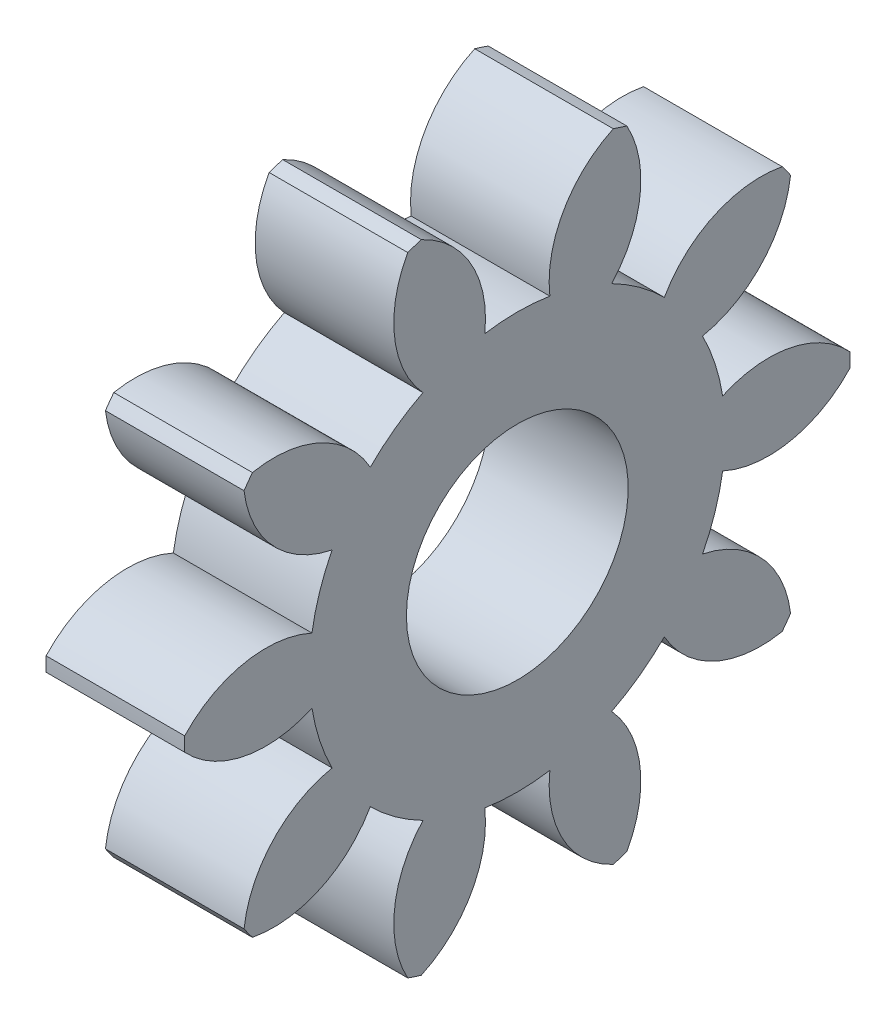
ISO-10303-21;
HEADER;
FILE_DESCRIPTION(('STEP AP214'),'2;1');
FILE_NAME('part.step','',(''),(''),'','','');
FILE_SCHEMA(('AUTOMOTIVE_DESIGN { 1 0 10303 214 1 1 1 1 }'));
ENDSEC;
DATA;
#1=APPLICATION_CONTEXT('core data for automotive mechanical design processes');
#2=APPLICATION_PROTOCOL_DEFINITION('international standard','automotive_design',2000,#1);
#3=PRODUCT_CONTEXT('',#1,'mechanical');
#4=PRODUCT('Part','Part','',(#3));
#5=PRODUCT_RELATED_PRODUCT_CATEGORY('part','',(#4));
#6=PRODUCT_DEFINITION_FORMATION('','',#4);
#7=PRODUCT_DEFINITION_CONTEXT('part definition',#1,'design');
#8=PRODUCT_DEFINITION('design','',#6,#7);
#9=PRODUCT_DEFINITION_SHAPE('','',#8);
#10=(LENGTH_UNIT() NAMED_UNIT(*) SI_UNIT(.MILLI.,.METRE.));
#11=(NAMED_UNIT(*) PLANE_ANGLE_UNIT() SI_UNIT($,.RADIAN.));
#12=(NAMED_UNIT(*) SI_UNIT($,.STERADIAN.) SOLID_ANGLE_UNIT());
#13=UNCERTAINTY_MEASURE_WITH_UNIT(LENGTH_MEASURE(1.E-05),#10,'distance_accuracy_value','');
#14=(GEOMETRIC_REPRESENTATION_CONTEXT(3) GLOBAL_UNCERTAINTY_ASSIGNED_CONTEXT((#13)) GLOBAL_UNIT_ASSIGNED_CONTEXT((#10,
#11,#12)) REPRESENTATION_CONTEXT('',''));
#15=CARTESIAN_POINT('',(0.,0.,0.));
#16=DIRECTION('',(0.,0.,1.));
#17=DIRECTION('',(1.,0.,0.));
#18=AXIS2_PLACEMENT_3D('',#15,#16,#17);
#19=CARTESIAN_POINT('',(5.,0.,0.));
#20=DIRECTION('',(-1.,0.,0.));
#21=DIRECTION('',(0.,0.,1.));
#22=AXIS2_PLACEMENT_3D('',#19,#20,#21);
#23=PLANE('',#22);
#24=CARTESIAN_POINT('',(5.,0.,0.));
#25=DIRECTION('',(-1.,0.,0.));
#26=DIRECTION('',(0.,0.,1.));
#27=AXIS2_PLACEMENT_3D('',#24,#25,#26);
#28=CIRCLE('',#27,4.);
#29=CARTESIAN_POINT('',(5.,0.,4.));
#30=VERTEX_POINT('',#29);
#31=EDGE_CURVE('E352',#30,#30,#28,.F.);
#32=ORIENTED_EDGE('',*,*,#31,.F.);
#33=EDGE_LOOP('',(#32));
#34=FACE_BOUND('',#33,.T.);
#35=CARTESIAN_POINT('',(5.,-2.46642274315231,-9.06746828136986));
#36=DIRECTION('',(-1.,0.,0.));
#37=DIRECTION('',(0.,-0.95105651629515,-0.309016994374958));
#38=AXIS2_PLACEMENT_3D('',#35,#36,#37);
#39=CIRCLE('',#38,4.);
#40=CARTESIAN_POINT('',(5.,1.17254140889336,-7.40676364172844));
#41=VERTEX_POINT('',#40);
#42=CARTESIAN_POINT('',(5.,0.256880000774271,-11.9972502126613));
#43=VERTEX_POINT('',#42);
#44=EDGE_CURVE('E358',#41,#43,#39,.T.);
#45=ORIENTED_EDGE('',*,*,#44,.F.);
#46=CARTESIAN_POINT('',(5.,0.,0.));
#47=DIRECTION('',(-1.,0.,0.));
#48=DIRECTION('',(0.,-0.95105651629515,-0.309016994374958));
#49=AXIS2_PLACEMENT_3D('',#46,#47,#48);
#50=CIRCLE('',#49,7.499);
#51=CARTESIAN_POINT('',(5.,3.40498050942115,-6.68140020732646));
#52=VERTEX_POINT('',#51);
#53=EDGE_CURVE('E363',#52,#41,#50,.T.);
#54=ORIENTED_EDGE('',*,*,#53,.F.);
#55=CARTESIAN_POINT('',(5.,7.32510204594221,-5.88600902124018));
#56=DIRECTION('',(-1.,0.,0.));
#57=DIRECTION('',(0.,-0.95105651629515,-0.309016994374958));
#58=AXIS2_PLACEMENT_3D('',#55,#56,#57);
#59=CIRCLE('',#58,4.);
#60=CARTESIAN_POINT('',(5.,6.84398645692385,-9.85696958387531));
#61=VERTEX_POINT('',#60);
#62=EDGE_CURVE('E360',#61,#52,#59,.T.);
#63=ORIENTED_EDGE('',*,*,#62,.F.);
#64=CARTESIAN_POINT('',(5.,0.,0.));
#65=DIRECTION('',(-1.,0.,0.));
#66=DIRECTION('',(0.,0.,1.));
#67=AXIS2_PLACEMENT_3D('',#64,#65,#66);
#68=CIRCLE('',#67,12.);
#69=CARTESIAN_POINT('',(5.,7.25962702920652,-9.55498903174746));
#70=VERTEX_POINT('',#69);
#71=EDGE_CURVE('E524',#70,#61,#68,.T.);
#72=ORIENTED_EDGE('',*,*,#71,.F.);
#73=CARTESIAN_POINT('',(5.,3.3343462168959,-8.78546284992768));
#74=DIRECTION('',(-1.,0.,0.));
#75=DIRECTION('',(0.,-0.587785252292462,-0.809016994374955));
#76=AXIS2_PLACEMENT_3D('',#73,#74,#75);
#77=CIRCLE('',#76,4.);
#78=CARTESIAN_POINT('',(5.,5.30219236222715,-5.30299511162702));
#79=VERTEX_POINT('',#78);
#80=EDGE_CURVE('E343',#79,#70,#77,.T.);
#81=ORIENTED_EDGE('',*,*,#80,.F.);
#82=CARTESIAN_POINT('',(5.,0.,0.));
#83=DIRECTION('',(-1.,0.,0.));
#84=DIRECTION('',(0.,-0.587785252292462,-0.809016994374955));
#85=AXIS2_PLACEMENT_3D('',#82,#83,#84);
#86=CIRCLE('',#85,7.499);
#87=CARTESIAN_POINT('',(5.,6.68191560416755,-3.40396898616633));
#88=VERTEX_POINT('',#87);
#89=EDGE_CURVE('E348',#88,#79,#86,.T.);
#90=ORIENTED_EDGE('',*,*,#89,.F.);
#91=CARTESIAN_POINT('',(5.,9.38584133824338,-0.456294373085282));
#92=DIRECTION('',(-1.,0.,0.));
#93=DIRECTION('',(0.,-0.587785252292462,-0.809016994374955));
#94=AXIS2_PLACEMENT_3D('',#91,#92,#93);
#95=CIRCLE('',#94,4.);
#96=CARTESIAN_POINT('',(5.,11.3306827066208,-3.9516616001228));
#97=VERTEX_POINT('',#96);
#98=EDGE_CURVE('E345',#97,#88,#95,.T.);
#99=ORIENTED_EDGE('',*,*,#98,.F.);
#100=CARTESIAN_POINT('',(5.,11.4894432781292,-3.46304680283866));
#101=VERTEX_POINT('',#100);
#102=EDGE_CURVE('E520',#101,#97,#68,.T.);
#103=ORIENTED_EDGE('',*,*,#102,.F.);
#104=CARTESIAN_POINT('',(5.,7.86150825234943,-5.14770921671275));
#105=DIRECTION('',(-1.,0.,0.));
#106=DIRECTION('',(0.,0.,-1.));
#107=AXIS2_PLACEMENT_3D('',#104,#105,#106);
#108=CIRCLE('',#107,4.);
#109=CARTESIAN_POINT('',(5.,7.40658604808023,-1.17366269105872));
#110=VERTEX_POINT('',#109);
#111=EDGE_CURVE('E492',#110,#101,#108,.T.);
#112=ORIENTED_EDGE('',*,*,#111,.F.);
#113=CARTESIAN_POINT('',(5.,0.,0.));
#114=DIRECTION('',(-1.,0.,0.));
#115=DIRECTION('',(0.,0.,-1.));
#116=AXIS2_PLACEMENT_3D('',#113,#114,#115);
#117=CIRCLE('',#116,7.499);
#118=CARTESIAN_POINT('',(5.,7.40658604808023,1.17366269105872));
#119=VERTEX_POINT('',#118);
#120=EDGE_CURVE('E497',#119,#110,#117,.T.);
#121=ORIENTED_EDGE('',*,*,#120,.F.);
#122=CARTESIAN_POINT('',(5.,7.86150825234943,5.14770921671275));
#123=DIRECTION('',(-1.,0.,0.));
#124=DIRECTION('',(0.,0.,-1.));
#125=AXIS2_PLACEMENT_3D('',#122,#123,#124);
#126=CIRCLE('',#125,4.);
#127=CARTESIAN_POINT('',(5.,11.4894432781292,3.46304680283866));
#128=VERTEX_POINT('',#127);
#129=EDGE_CURVE('E494',#128,#119,#126,.T.);
#130=ORIENTED_EDGE('',*,*,#129,.F.);
#131=CARTESIAN_POINT('',(5.,11.3306827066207,3.95166160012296));
#132=VERTEX_POINT('',#131);
#133=EDGE_CURVE('E517',#132,#128,#68,.T.);
#134=ORIENTED_EDGE('',*,*,#133,.F.);
#135=CARTESIAN_POINT('',(5.,9.38584133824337,0.456294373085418));
#136=DIRECTION('',(-1.,0.,0.));
#137=DIRECTION('',(0.,0.587785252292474,-0.809016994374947));
#138=AXIS2_PLACEMENT_3D('',#135,#136,#137);
#139=CIRCLE('',#138,4.);
#140=CARTESIAN_POINT('',(5.,6.6819156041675,3.40396898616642));
#141=VERTEX_POINT('',#140);
#142=EDGE_CURVE('E470',#141,#132,#139,.T.);
#143=ORIENTED_EDGE('',*,*,#142,.F.);
#144=CARTESIAN_POINT('',(5.,0.,0.));
#145=DIRECTION('',(-1.,0.,0.));
#146=DIRECTION('',(0.,0.587785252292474,-0.809016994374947));
#147=AXIS2_PLACEMENT_3D('',#144,#145,#146);
#148=CIRCLE('',#147,7.499);
#149=CARTESIAN_POINT('',(5.,5.30219236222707,5.3029951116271));
#150=VERTEX_POINT('',#149);
#151=EDGE_CURVE('E475',#150,#141,#148,.T.);
#152=ORIENTED_EDGE('',*,*,#151,.F.);
#153=CARTESIAN_POINT('',(5.,3.33434621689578,8.78546284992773));
#154=DIRECTION('',(-1.,0.,0.));
#155=DIRECTION('',(0.,0.587785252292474,-0.809016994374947));
#156=AXIS2_PLACEMENT_3D('',#153,#154,#155);
#157=CIRCLE('',#156,4.);
#158=CARTESIAN_POINT('',(5.,7.25962702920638,9.55498903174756));
#159=VERTEX_POINT('',#158);
#160=EDGE_CURVE('E472',#159,#150,#157,.T.);
#161=ORIENTED_EDGE('',*,*,#160,.F.);
#162=CARTESIAN_POINT('',(5.,6.84398645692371,9.8569695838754));
#163=VERTEX_POINT('',#162);
#164=EDGE_CURVE('E525',#163,#159,#68,.T.);
#165=ORIENTED_EDGE('',*,*,#164,.F.);
#166=CARTESIAN_POINT('',(5.,7.32510204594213,5.88600902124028));
#167=DIRECTION('',(-1.,0.,0.));
#168=DIRECTION('',(0.,0.951056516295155,-0.309016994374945));
#169=AXIS2_PLACEMENT_3D('',#166,#167,#168);
#170=CIRCLE('',#169,4.);
#171=CARTESIAN_POINT('',(5.,3.40498050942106,6.68140020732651));
#172=VERTEX_POINT('',#171);
#173=EDGE_CURVE('E405',#172,#163,#170,.T.);
#174=ORIENTED_EDGE('',*,*,#173,.F.);
#175=CARTESIAN_POINT('',(5.,0.,0.));
#176=DIRECTION('',(-1.,0.,0.));
#177=DIRECTION('',(0.,0.951056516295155,-0.309016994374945));
#178=AXIS2_PLACEMENT_3D('',#175,#176,#177);
#179=CIRCLE('',#178,7.499);
#180=CARTESIAN_POINT('',(5.,1.17254140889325,7.40676364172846));
#181=VERTEX_POINT('',#180);
#182=EDGE_CURVE('E410',#181,#172,#179,.T.);
#183=ORIENTED_EDGE('',*,*,#182,.F.);
#184=CARTESIAN_POINT('',(5.,-2.46642274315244,9.06746828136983));
#185=DIRECTION('',(-1.,0.,0.));
#186=DIRECTION('',(0.,0.951056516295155,-0.309016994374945));
#187=AXIS2_PLACEMENT_3D('',#184,#185,#186);
#188=CIRCLE('',#187,4.);
#189=CARTESIAN_POINT('',(5.,0.256880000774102,11.9972502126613));
#190=VERTEX_POINT('',#189);
#191=EDGE_CURVE('E407',#190,#181,#188,.T.);
#192=ORIENTED_EDGE('',*,*,#191,.F.);
#193=CARTESIAN_POINT('',(5.,-0.256880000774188,11.9972502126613));
#194=VERTEX_POINT('',#193);
#195=EDGE_CURVE('E688',#194,#190,#68,.T.);
#196=ORIENTED_EDGE('',*,*,#195,.F.);
#197=CARTESIAN_POINT('',(5.,2.46642274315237,9.06746828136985));
#198=DIRECTION('',(-1.,0.,0.));
#199=DIRECTION('',(0.,0.951056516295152,0.309016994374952));
#200=AXIS2_PLACEMENT_3D('',#197,#198,#199);
#201=CIRCLE('',#200,4.);
#202=CARTESIAN_POINT('',(5.,-1.17254140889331,7.40676364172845));
#203=VERTEX_POINT('',#202);
#204=EDGE_CURVE('E424',#203,#194,#201,.T.);
#205=ORIENTED_EDGE('',*,*,#204,.F.);
#206=CARTESIAN_POINT('',(5.,0.,0.));
#207=DIRECTION('',(-1.,0.,0.));
#208=DIRECTION('',(0.,0.951056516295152,0.309016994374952));
#209=AXIS2_PLACEMENT_3D('',#206,#207,#208);
#210=CIRCLE('',#209,7.499);
#211=CARTESIAN_POINT('',(5.,-3.4049805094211,6.68140020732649));
#212=VERTEX_POINT('',#211);
#213=EDGE_CURVE('E429',#212,#203,#210,.T.);
#214=ORIENTED_EDGE('',*,*,#213,.F.);
#215=CARTESIAN_POINT('',(5.,-7.32510204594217,5.88600902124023));
#216=DIRECTION('',(-1.,0.,0.));
#217=DIRECTION('',(0.,0.951056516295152,0.309016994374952));
#218=AXIS2_PLACEMENT_3D('',#215,#216,#217);
#219=CIRCLE('',#218,4.);
#220=CARTESIAN_POINT('',(5.,-6.84398645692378,9.85696958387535));
#221=VERTEX_POINT('',#220);
#222=EDGE_CURVE('E426',#221,#212,#219,.T.);
#223=ORIENTED_EDGE('',*,*,#222,.F.);
#224=CARTESIAN_POINT('',(5.,-7.25962702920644,9.55498903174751));
#225=VERTEX_POINT('',#224);
#226=EDGE_CURVE('E669',#225,#221,#68,.T.);
#227=ORIENTED_EDGE('',*,*,#226,.F.);
#228=CARTESIAN_POINT('',(5.,-3.33434621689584,8.78546284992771));
#229=DIRECTION('',(-1.,0.,0.));
#230=DIRECTION('',(0.,0.587785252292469,0.809016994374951));
#231=AXIS2_PLACEMENT_3D('',#228,#229,#230);
#232=CIRCLE('',#231,4.);
#233=CARTESIAN_POINT('',(5.,-5.30219236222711,5.30299511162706));
#234=VERTEX_POINT('',#233);
#235=EDGE_CURVE('E388',#234,#225,#232,.T.);
#236=ORIENTED_EDGE('',*,*,#235,.F.);
#237=CARTESIAN_POINT('',(5.,0.,0.));
#238=DIRECTION('',(-1.,0.,0.));
#239=DIRECTION('',(0.,0.587785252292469,0.809016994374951));
#240=AXIS2_PLACEMENT_3D('',#237,#238,#239);
#241=CIRCLE('',#240,7.499);
#242=CARTESIAN_POINT('',(5.,-6.68191560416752,3.40396898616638));
#243=VERTEX_POINT('',#242);
#244=EDGE_CURVE('E393',#243,#234,#241,.T.);
#245=ORIENTED_EDGE('',*,*,#244,.F.);
#246=CARTESIAN_POINT('',(5.,-9.38584133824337,0.456294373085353));
#247=DIRECTION('',(-1.,0.,0.));
#248=DIRECTION('',(0.,0.587785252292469,0.809016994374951));
#249=AXIS2_PLACEMENT_3D('',#246,#247,#248);
#250=CIRCLE('',#249,4.);
#251=CARTESIAN_POINT('',(5.,-11.3306827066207,3.95166160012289));
#252=VERTEX_POINT('',#251);
#253=EDGE_CURVE('E390',#252,#243,#250,.T.);
#254=ORIENTED_EDGE('',*,*,#253,.F.);
#255=CARTESIAN_POINT('',(5.,-11.4894432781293,3.46304680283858));
#256=VERTEX_POINT('',#255);
#257=EDGE_CURVE('E650',#256,#252,#68,.T.);
#258=ORIENTED_EDGE('',*,*,#257,.F.);
#259=CARTESIAN_POINT('',(5.,-7.86150825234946,5.14770921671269));
#260=DIRECTION('',(-1.,0.,0.));
#261=DIRECTION('',(0.,0.,1.));
#262=AXIS2_PLACEMENT_3D('',#259,#260,#261);
#263=CIRCLE('',#262,4.);
#264=CARTESIAN_POINT('',(5.,-7.40658604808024,1.17366269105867));
#265=VERTEX_POINT('',#264);
#266=EDGE_CURVE('E371',#265,#256,#263,.T.);
#267=ORIENTED_EDGE('',*,*,#266,.F.);
#268=CARTESIAN_POINT('',(5.,0.,0.));
#269=DIRECTION('',(-1.,0.,0.));
#270=DIRECTION('',(0.,0.,1.));
#271=AXIS2_PLACEMENT_3D('',#268,#269,#270);
#272=CIRCLE('',#271,7.499);
#273=CARTESIAN_POINT('',(5.,-7.40658604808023,-1.17366269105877));
#274=VERTEX_POINT('',#273);
#275=EDGE_CURVE('E376',#274,#265,#272,.T.);
#276=ORIENTED_EDGE('',*,*,#275,.F.);
#277=CARTESIAN_POINT('',(5.,-7.86150825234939,-5.1477092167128));
#278=DIRECTION('',(-1.,0.,0.));
#279=DIRECTION('',(0.,0.,1.));
#280=AXIS2_PLACEMENT_3D('',#277,#278,#279);
#281=CIRCLE('',#280,4.);
#282=CARTESIAN_POINT('',(5.,-11.4894432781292,-3.46304680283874));
#283=VERTEX_POINT('',#282);
#284=EDGE_CURVE('E373',#283,#274,#281,.T.);
#285=ORIENTED_EDGE('',*,*,#284,.F.);
#286=CARTESIAN_POINT('',(5.,-11.3306827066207,-3.95166160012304));
#287=VERTEX_POINT('',#286);
#288=EDGE_CURVE('E631',#287,#283,#68,.T.);
#289=ORIENTED_EDGE('',*,*,#288,.F.);
#290=CARTESIAN_POINT('',(5.,-9.38584133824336,-0.456294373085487));
#291=DIRECTION('',(-1.,0.,0.));
#292=DIRECTION('',(0.,-0.58778525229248,0.809016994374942));
#293=AXIS2_PLACEMENT_3D('',#290,#291,#292);
#294=CIRCLE('',#293,4.);
#295=CARTESIAN_POINT('',(5.,-6.68191560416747,-3.40396898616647));
#296=VERTEX_POINT('',#295);
#297=EDGE_CURVE('E326',#296,#287,#294,.T.);
#298=ORIENTED_EDGE('',*,*,#297,.F.);
#299=CARTESIAN_POINT('',(5.,0.,0.));
#300=DIRECTION('',(-1.,0.,0.));
#301=DIRECTION('',(0.,-0.58778525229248,0.809016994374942));
#302=AXIS2_PLACEMENT_3D('',#299,#300,#301);
#303=CIRCLE('',#302,7.499);
#304=CARTESIAN_POINT('',(5.,-5.30219236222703,-5.30299511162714));
#305=VERTEX_POINT('',#304);
#306=EDGE_CURVE('E331',#305,#296,#303,.T.);
#307=ORIENTED_EDGE('',*,*,#306,.F.);
#308=CARTESIAN_POINT('',(5.,-3.33434621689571,-8.78546284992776));
#309=DIRECTION('',(-1.,0.,0.));
#310=DIRECTION('',(0.,-0.58778525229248,0.809016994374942));
#311=AXIS2_PLACEMENT_3D('',#308,#309,#310);
#312=CIRCLE('',#311,4.);
#313=CARTESIAN_POINT('',(5.,-7.25962702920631,-9.55498903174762));
#314=VERTEX_POINT('',#313);
#315=EDGE_CURVE('E328',#314,#305,#312,.T.);
#316=ORIENTED_EDGE('',*,*,#315,.F.);
#317=CARTESIAN_POINT('',(5.,-6.84398645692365,-9.85696958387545));
#318=VERTEX_POINT('',#317);
#319=EDGE_CURVE('E612',#318,#314,#68,.T.);
#320=ORIENTED_EDGE('',*,*,#319,.F.);
#321=CARTESIAN_POINT('',(5.,-7.32510204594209,-5.88600902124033));
#322=DIRECTION('',(-1.,0.,0.));
#323=DIRECTION('',(0.,-0.951056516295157,0.309016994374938));
#324=AXIS2_PLACEMENT_3D('',#321,#322,#323);
#325=CIRCLE('',#324,4.);
#326=CARTESIAN_POINT('',(5.,-3.40498050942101,-6.68140020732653));
#327=VERTEX_POINT('',#326);
#328=EDGE_CURVE('E302',#327,#318,#325,.T.);
#329=ORIENTED_EDGE('',*,*,#328,.F.);
#330=CARTESIAN_POINT('',(5.,0.,0.));
#331=DIRECTION('',(-1.,0.,0.));
#332=DIRECTION('',(0.,-0.951056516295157,0.309016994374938));
#333=AXIS2_PLACEMENT_3D('',#330,#331,#332);
#334=CIRCLE('',#333,7.499);
#335=CARTESIAN_POINT('',(5.,-1.1725414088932,-7.40676364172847));
#336=VERTEX_POINT('',#335);
#337=EDGE_CURVE('E301',#336,#327,#334,.T.);
#338=ORIENTED_EDGE('',*,*,#337,.F.);
#339=CARTESIAN_POINT('',(5.,2.4664227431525,-9.06746828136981));
#340=DIRECTION('',(-1.,0.,0.));
#341=DIRECTION('',(0.,-0.951056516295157,0.309016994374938));
#342=AXIS2_PLACEMENT_3D('',#339,#340,#341);
#343=CIRCLE('',#342,4.);
#344=CARTESIAN_POINT('',(5.,-0.25688000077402,-11.9972502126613));
#345=VERTEX_POINT('',#344);
#346=EDGE_CURVE('E290',#345,#336,#343,.T.);
#347=ORIENTED_EDGE('',*,*,#346,.F.);
#348=EDGE_CURVE('E748',#43,#345,#68,.T.);
#349=ORIENTED_EDGE('',*,*,#348,.F.);
#350=EDGE_LOOP('',(#45,#54,#63,#72,#81,#90,#99,#103,#112,#121,#130,#134,#143,#152,#161,#165,
#174,#183,#192,#196,#205,#214,#223,#227,#236,#245,#254,#258,#267,#276,#285,#289,#298,#307,#316,
#320,#329,#338,#347,#349));
#351=FACE_BOUND('',#350,.T.);
#352=ADVANCED_FACE('F33',(#34,#351),#23,.F.);
#353=CARTESIAN_POINT('',(-10.,0.,0.));
#354=DIRECTION('',(-1.,0.,0.));
#355=DIRECTION('',(0.,0.,1.));
#356=AXIS2_PLACEMENT_3D('',#353,#354,#355);
#357=CYLINDRICAL_SURFACE('',#356,12.);
#358=DIRECTION('',(-1.,0.,0.));
#359=VECTOR('',#358,1.);
#360=CARTESIAN_POINT('',(2.5,0.256880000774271,-11.9972502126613));
#361=LINE('',#360,#359);
#362=CARTESIAN_POINT('',(0.,0.25688000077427,-11.9972502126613));
#363=VERTEX_POINT('',#362);
#364=EDGE_CURVE('E467',#43,#363,#361,.T.);
#365=ORIENTED_EDGE('',*,*,#364,.F.);
#366=ORIENTED_EDGE('',*,*,#348,.T.);
#367=DIRECTION('',(-1.,0.,0.));
#368=VECTOR('',#367,1.);
#369=CARTESIAN_POINT('',(2.5,-0.25688000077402,-11.9972502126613));
#370=LINE('',#369,#368);
#371=CARTESIAN_POINT('',(0.,-0.25688000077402,-11.9972502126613));
#372=VERTEX_POINT('',#371);
#373=EDGE_CURVE('E296',#372,#345,#370,.F.);
#374=ORIENTED_EDGE('',*,*,#373,.F.);
#375=CARTESIAN_POINT('',(0.,0.,0.));
#376=DIRECTION('',(-1.,0.,0.));
#377=DIRECTION('',(0.,0.,1.));
#378=AXIS2_PLACEMENT_3D('',#375,#376,#377);
#379=CIRCLE('',#378,12.);
#380=EDGE_CURVE('E582',#363,#372,#379,.T.);
#381=ORIENTED_EDGE('',*,*,#380,.F.);
#382=EDGE_LOOP('',(#365,#366,#374,#381));
#383=FACE_BOUND('',#382,.T.);
#384=ADVANCED_FACE('F733',(#383),#357,.T.);
#385=DIRECTION('',(-1.,0.,0.));
#386=VECTOR('',#385,1.);
#387=CARTESIAN_POINT('',(2.5,6.84398645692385,-9.85696958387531));
#388=LINE('',#387,#386);
#389=CARTESIAN_POINT('',(0.,6.84398645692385,-9.85696958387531));
#390=VERTEX_POINT('',#389);
#391=EDGE_CURVE('E465',#390,#61,#388,.F.);
#392=ORIENTED_EDGE('',*,*,#391,.F.);
#393=CARTESIAN_POINT('',(0.,7.25962702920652,-9.55498903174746));
#394=VERTEX_POINT('',#393);
#395=EDGE_CURVE('E518',#394,#390,#379,.T.);
#396=ORIENTED_EDGE('',*,*,#395,.F.);
#397=DIRECTION('',(-1.,0.,0.));
#398=VECTOR('',#397,1.);
#399=CARTESIAN_POINT('',(2.5,7.25962702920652,-9.55498903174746));
#400=LINE('',#399,#398);
#401=EDGE_CURVE('E463',#70,#394,#400,.T.);
#402=ORIENTED_EDGE('',*,*,#401,.F.);
#403=ORIENTED_EDGE('',*,*,#71,.T.);
#404=EDGE_LOOP('',(#392,#396,#402,#403));
#405=FACE_BOUND('',#404,.T.);
#406=ADVANCED_FACE('F579',(#405),#357,.T.);
#407=DIRECTION('',(-1.,0.,0.));
#408=VECTOR('',#407,1.);
#409=CARTESIAN_POINT('',(2.5,11.3306827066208,-3.9516616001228));
#410=LINE('',#409,#408);
#411=CARTESIAN_POINT('',(0.,11.3306827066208,-3.9516616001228));
#412=VERTEX_POINT('',#411);
#413=EDGE_CURVE('E461',#412,#97,#410,.F.);
#414=ORIENTED_EDGE('',*,*,#413,.F.);
#415=CARTESIAN_POINT('',(0.,11.4894432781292,-3.46304680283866));
#416=VERTEX_POINT('',#415);
#417=EDGE_CURVE('E514',#416,#412,#379,.T.);
#418=ORIENTED_EDGE('',*,*,#417,.F.);
#419=DIRECTION('',(-1.,0.,0.));
#420=VECTOR('',#419,1.);
#421=CARTESIAN_POINT('',(2.5,11.4894432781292,-3.46304680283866));
#422=LINE('',#421,#420);
#423=EDGE_CURVE('E511',#101,#416,#422,.T.);
#424=ORIENTED_EDGE('',*,*,#423,.F.);
#425=ORIENTED_EDGE('',*,*,#102,.T.);
#426=EDGE_LOOP('',(#414,#418,#424,#425));
#427=FACE_BOUND('',#426,.T.);
#428=ADVANCED_FACE('F553',(#427),#357,.T.);
#429=DIRECTION('',(-1.,0.,0.));
#430=VECTOR('',#429,1.);
#431=CARTESIAN_POINT('',(2.5,-11.3306827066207,-3.95166160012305));
#432=LINE('',#431,#430);
#433=CARTESIAN_POINT('',(0.,-11.3306827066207,-3.95166160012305));
#434=VERTEX_POINT('',#433);
#435=EDGE_CURVE('E459',#287,#434,#432,.T.);
#436=ORIENTED_EDGE('',*,*,#435,.F.);
#437=ORIENTED_EDGE('',*,*,#288,.T.);
#438=DIRECTION('',(-1.,0.,0.));
#439=VECTOR('',#438,1.);
#440=CARTESIAN_POINT('',(2.5,-11.4894432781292,-3.46304680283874));
#441=LINE('',#440,#439);
#442=CARTESIAN_POINT('',(0.,-11.4894432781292,-3.46304680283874));
#443=VERTEX_POINT('',#442);
#444=EDGE_CURVE('E442',#443,#283,#441,.F.);
#445=ORIENTED_EDGE('',*,*,#444,.F.);
#446=EDGE_CURVE('E598',#434,#443,#379,.T.);
#447=ORIENTED_EDGE('',*,*,#446,.F.);
#448=EDGE_LOOP('',(#436,#437,#445,#447));
#449=FACE_BOUND('',#448,.T.);
#450=ADVANCED_FACE('F629',(#449),#357,.T.);
#451=DIRECTION('',(-1.,0.,0.));
#452=VECTOR('',#451,1.);
#453=CARTESIAN_POINT('',(2.5,-7.2596270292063,-9.55498903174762));
#454=LINE('',#453,#452);
#455=CARTESIAN_POINT('',(0.,-7.2596270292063,-9.55498903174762));
#456=VERTEX_POINT('',#455);
#457=EDGE_CURVE('E457',#456,#314,#454,.F.);
#458=ORIENTED_EDGE('',*,*,#457,.F.);
#459=CARTESIAN_POINT('',(0.,-6.84398645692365,-9.85696958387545));
#460=VERTEX_POINT('',#459);
#461=EDGE_CURVE('E584',#460,#456,#379,.T.);
#462=ORIENTED_EDGE('',*,*,#461,.F.);
#463=DIRECTION('',(-1.,0.,0.));
#464=VECTOR('',#463,1.);
#465=CARTESIAN_POINT('',(2.5,-6.84398645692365,-9.85696958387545));
#466=LINE('',#465,#464);
#467=EDGE_CURVE('E455',#318,#460,#466,.T.);
#468=ORIENTED_EDGE('',*,*,#467,.F.);
#469=ORIENTED_EDGE('',*,*,#319,.T.);
#470=EDGE_LOOP('',(#458,#462,#468,#469));
#471=FACE_BOUND('',#470,.T.);
#472=ADVANCED_FACE('F610',(#471),#357,.T.);
#473=DIRECTION('',(-1.,0.,0.));
#474=VECTOR('',#473,1.);
#475=CARTESIAN_POINT('',(2.5,6.84398645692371,9.8569695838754));
#476=LINE('',#475,#474);
#477=CARTESIAN_POINT('',(0.,6.84398645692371,9.8569695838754));
#478=VERTEX_POINT('',#477);
#479=EDGE_CURVE('E452',#163,#478,#476,.T.);
#480=ORIENTED_EDGE('',*,*,#479,.F.);
#481=ORIENTED_EDGE('',*,*,#164,.T.);
#482=DIRECTION('',(-1.,0.,0.));
#483=VECTOR('',#482,1.);
#484=CARTESIAN_POINT('',(2.5,7.25962702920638,9.55498903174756));
#485=LINE('',#484,#483);
#486=CARTESIAN_POINT('',(0.,7.25962702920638,9.55498903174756));
#487=VERTEX_POINT('',#486);
#488=EDGE_CURVE('E486',#487,#159,#485,.F.);
#489=ORIENTED_EDGE('',*,*,#488,.F.);
#490=EDGE_CURVE('E519',#478,#487,#379,.T.);
#491=ORIENTED_EDGE('',*,*,#490,.F.);
#492=EDGE_LOOP('',(#480,#481,#489,#491));
#493=FACE_BOUND('',#492,.T.);
#494=ADVANCED_FACE('F705',(#493),#357,.T.);
#495=DIRECTION('',(-1.,0.,0.));
#496=VECTOR('',#495,1.);
#497=CARTESIAN_POINT('',(2.5,0.256880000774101,11.9972502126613));
#498=LINE('',#497,#496);
#499=CARTESIAN_POINT('',(0.,0.256880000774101,11.9972502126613));
#500=VERTEX_POINT('',#499);
#501=EDGE_CURVE('E450',#500,#190,#498,.F.);
#502=ORIENTED_EDGE('',*,*,#501,.F.);
#503=CARTESIAN_POINT('',(0.,-0.256880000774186,11.9972502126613));
#504=VERTEX_POINT('',#503);
#505=EDGE_CURVE('E586',#504,#500,#379,.T.);
#506=ORIENTED_EDGE('',*,*,#505,.F.);
#507=DIRECTION('',(-1.,0.,0.));
#508=VECTOR('',#507,1.);
#509=CARTESIAN_POINT('',(2.5,-0.256880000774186,11.9972502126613));
#510=LINE('',#509,#508);
#511=EDGE_CURVE('E448',#194,#504,#510,.T.);
#512=ORIENTED_EDGE('',*,*,#511,.F.);
#513=ORIENTED_EDGE('',*,*,#195,.T.);
#514=EDGE_LOOP('',(#502,#506,#512,#513));
#515=FACE_BOUND('',#514,.T.);
#516=ADVANCED_FACE('F686',(#515),#357,.T.);
#517=DIRECTION('',(-1.,0.,0.));
#518=VECTOR('',#517,1.);
#519=CARTESIAN_POINT('',(2.5,-6.84398645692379,9.85696958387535));
#520=LINE('',#519,#518);
#521=CARTESIAN_POINT('',(0.,-6.84398645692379,9.85696958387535));
#522=VERTEX_POINT('',#521);
#523=EDGE_CURVE('E446',#522,#221,#520,.F.);
#524=ORIENTED_EDGE('',*,*,#523,.F.);
#525=CARTESIAN_POINT('',(0.,-7.25962702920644,9.55498903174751));
#526=VERTEX_POINT('',#525);
#527=EDGE_CURVE('E590',#526,#522,#379,.T.);
#528=ORIENTED_EDGE('',*,*,#527,.F.);
#529=DIRECTION('',(-1.,0.,0.));
#530=VECTOR('',#529,1.);
#531=CARTESIAN_POINT('',(2.5,-7.25962702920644,9.55498903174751));
#532=LINE('',#531,#530);
#533=EDGE_CURVE('E440',#225,#526,#532,.T.);
#534=ORIENTED_EDGE('',*,*,#533,.F.);
#535=ORIENTED_EDGE('',*,*,#226,.T.);
#536=EDGE_LOOP('',(#524,#528,#534,#535));
#537=FACE_BOUND('',#536,.T.);
#538=ADVANCED_FACE('F667',(#537),#357,.T.);
#539=DIRECTION('',(-1.,0.,0.));
#540=VECTOR('',#539,1.);
#541=CARTESIAN_POINT('',(2.5,-11.4894432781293,3.46304680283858));
#542=LINE('',#541,#540);
#543=CARTESIAN_POINT('',(0.,-11.4894432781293,3.46304680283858));
#544=VERTEX_POINT('',#543);
#545=EDGE_CURVE('E444',#256,#544,#542,.T.);
#546=ORIENTED_EDGE('',*,*,#545,.F.);
#547=ORIENTED_EDGE('',*,*,#257,.T.);
#548=DIRECTION('',(-1.,0.,0.));
#549=VECTOR('',#548,1.);
#550=CARTESIAN_POINT('',(2.5,-11.3306827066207,3.95166160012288));
#551=LINE('',#550,#549);
#552=CARTESIAN_POINT('',(0.,-11.3306827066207,3.95166160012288));
#553=VERTEX_POINT('',#552);
#554=EDGE_CURVE('E423',#553,#252,#551,.F.);
#555=ORIENTED_EDGE('',*,*,#554,.F.);
#556=EDGE_CURVE('E594',#544,#553,#379,.T.);
#557=ORIENTED_EDGE('',*,*,#556,.F.);
#558=EDGE_LOOP('',(#546,#547,#555,#557));
#559=FACE_BOUND('',#558,.T.);
#560=ADVANCED_FACE('F648',(#559),#357,.T.);
#561=CARTESIAN_POINT('',(0.,0.,0.));
#562=DIRECTION('',(1.,0.,0.));
#563=DIRECTION('',(0.,0.,-1.));
#564=AXIS2_PLACEMENT_3D('',#561,#562,#563);
#565=PLANE('',#564);
#566=CARTESIAN_POINT('',(0.,0.,0.));
#567=DIRECTION('',(1.,0.,0.));
#568=DIRECTION('',(0.,0.,-1.));
#569=AXIS2_PLACEMENT_3D('',#566,#567,#568);
#570=CIRCLE('',#569,4.);
#571=CARTESIAN_POINT('',(0.,0.,-4.));
#572=VERTEX_POINT('',#571);
#573=EDGE_CURVE('E36',#572,#572,#570,.F.);
#574=ORIENTED_EDGE('',*,*,#573,.F.);
#575=EDGE_LOOP('',(#574));
#576=FACE_BOUND('',#575,.T.);
#577=CARTESIAN_POINT('',(0.,-2.46642274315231,-9.06746828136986));
#578=DIRECTION('',(-1.,0.,0.));
#579=DIRECTION('',(0.,-0.95105651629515,-0.309016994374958));
#580=AXIS2_PLACEMENT_3D('',#577,#578,#579);
#581=CIRCLE('',#580,4.);
#582=CARTESIAN_POINT('',(0.,1.17254140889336,-7.40676364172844));
#583=VERTEX_POINT('',#582);
#584=EDGE_CURVE('E48',#583,#363,#581,.T.);
#585=ORIENTED_EDGE('',*,*,#584,.T.);
#586=ORIENTED_EDGE('',*,*,#380,.T.);
#587=CARTESIAN_POINT('',(0.,2.4664227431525,-9.06746828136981));
#588=DIRECTION('',(1.,0.,0.));
#589=DIRECTION('',(0.,0.,-1.));
#590=AXIS2_PLACEMENT_3D('',#587,#588,#589);
#591=CIRCLE('',#590,4.);
#592=CARTESIAN_POINT('',(0.,-1.1725414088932,-7.40676364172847));
#593=VERTEX_POINT('',#592);
#594=EDGE_CURVE('E539',#593,#372,#591,.T.);
#595=ORIENTED_EDGE('',*,*,#594,.F.);
#596=CARTESIAN_POINT('',(0.,0.,0.));
#597=DIRECTION('',(-1.,0.,0.));
#598=DIRECTION('',(0.,-0.951056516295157,0.309016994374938));
#599=AXIS2_PLACEMENT_3D('',#596,#597,#598);
#600=CIRCLE('',#599,7.499);
#601=CARTESIAN_POINT('',(0.,-3.40498050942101,-6.68140020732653));
#602=VERTEX_POINT('',#601);
#603=EDGE_CURVE('E309',#593,#602,#600,.T.);
#604=ORIENTED_EDGE('',*,*,#603,.T.);
#605=CARTESIAN_POINT('',(0.,-7.32510204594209,-5.88600902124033));
#606=DIRECTION('',(-1.,0.,0.));
#607=DIRECTION('',(0.,-0.951056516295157,0.309016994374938));
#608=AXIS2_PLACEMENT_3D('',#605,#606,#607);
#609=CIRCLE('',#608,4.);
#610=EDGE_CURVE('E321',#602,#460,#609,.T.);
#611=ORIENTED_EDGE('',*,*,#610,.T.);
#612=ORIENTED_EDGE('',*,*,#461,.T.);
#613=CARTESIAN_POINT('',(0.,-3.33434621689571,-8.78546284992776));
#614=DIRECTION('',(1.,0.,0.));
#615=DIRECTION('',(0.,0.,-1.));
#616=AXIS2_PLACEMENT_3D('',#613,#614,#615);
#617=CIRCLE('',#616,4.);
#618=CARTESIAN_POINT('',(0.,-5.30219236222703,-5.30299511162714));
#619=VERTEX_POINT('',#618);
#620=EDGE_CURVE('E541',#619,#456,#617,.T.);
#621=ORIENTED_EDGE('',*,*,#620,.F.);
#622=CARTESIAN_POINT('',(0.,0.,0.));
#623=DIRECTION('',(-1.,0.,0.));
#624=DIRECTION('',(0.,-0.58778525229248,0.809016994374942));
#625=AXIS2_PLACEMENT_3D('',#622,#623,#624);
#626=CIRCLE('',#625,7.499);
#627=CARTESIAN_POINT('',(0.,-6.68191560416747,-3.40396898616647));
#628=VERTEX_POINT('',#627);
#629=EDGE_CURVE('E329',#619,#628,#626,.T.);
#630=ORIENTED_EDGE('',*,*,#629,.T.);
#631=CARTESIAN_POINT('',(0.,-9.38584133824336,-0.456294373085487));
#632=DIRECTION('',(-1.,0.,0.));
#633=DIRECTION('',(0.,-0.58778525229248,0.809016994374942));
#634=AXIS2_PLACEMENT_3D('',#631,#632,#633);
#635=CIRCLE('',#634,4.);
#636=EDGE_CURVE('E311',#628,#434,#635,.T.);
#637=ORIENTED_EDGE('',*,*,#636,.T.);
#638=ORIENTED_EDGE('',*,*,#446,.T.);
#639=CARTESIAN_POINT('',(0.,-7.86150825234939,-5.1477092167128));
#640=DIRECTION('',(1.,0.,0.));
#641=DIRECTION('',(0.,0.,-1.));
#642=AXIS2_PLACEMENT_3D('',#639,#640,#641);
#643=CIRCLE('',#642,4.);
#644=CARTESIAN_POINT('',(0.,-7.40658604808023,-1.17366269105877));
#645=VERTEX_POINT('',#644);
#646=EDGE_CURVE('E533',#645,#443,#643,.T.);
#647=ORIENTED_EDGE('',*,*,#646,.F.);
#648=CARTESIAN_POINT('',(0.,0.,0.));
#649=DIRECTION('',(-1.,0.,0.));
#650=DIRECTION('',(0.,0.,1.));
#651=AXIS2_PLACEMENT_3D('',#648,#649,#650);
#652=CIRCLE('',#651,7.499);
#653=CARTESIAN_POINT('',(0.,-7.40658604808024,1.17366269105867));
#654=VERTEX_POINT('',#653);
#655=EDGE_CURVE('E374',#645,#654,#652,.T.);
#656=ORIENTED_EDGE('',*,*,#655,.T.);
#657=CARTESIAN_POINT('',(0.,-7.86150825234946,5.14770921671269));
#658=DIRECTION('',(-1.,0.,0.));
#659=DIRECTION('',(0.,0.,1.));
#660=AXIS2_PLACEMENT_3D('',#657,#658,#659);
#661=CIRCLE('',#660,4.);
#662=EDGE_CURVE('E342',#654,#544,#661,.T.);
#663=ORIENTED_EDGE('',*,*,#662,.T.);
#664=ORIENTED_EDGE('',*,*,#556,.T.);
#665=CARTESIAN_POINT('',(0.,-9.38584133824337,0.456294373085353));
#666=DIRECTION('',(1.,0.,0.));
#667=DIRECTION('',(0.,0.,-1.));
#668=AXIS2_PLACEMENT_3D('',#665,#666,#667);
#669=CIRCLE('',#668,4.);
#670=CARTESIAN_POINT('',(0.,-6.68191560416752,3.40396898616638));
#671=VERTEX_POINT('',#670);
#672=EDGE_CURVE('E531',#671,#553,#669,.T.);
#673=ORIENTED_EDGE('',*,*,#672,.F.);
#674=CARTESIAN_POINT('',(0.,0.,0.));
#675=DIRECTION('',(-1.,0.,0.));
#676=DIRECTION('',(0.,0.587785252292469,0.809016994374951));
#677=AXIS2_PLACEMENT_3D('',#674,#675,#676);
#678=CIRCLE('',#677,7.499);
#679=CARTESIAN_POINT('',(0.,-5.30219236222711,5.30299511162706));
#680=VERTEX_POINT('',#679);
#681=EDGE_CURVE('E391',#671,#680,#678,.T.);
#682=ORIENTED_EDGE('',*,*,#681,.T.);
#683=CARTESIAN_POINT('',(0.,-3.33434621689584,8.78546284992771));
#684=DIRECTION('',(-1.,0.,0.));
#685=DIRECTION('',(0.,0.587785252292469,0.809016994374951));
#686=AXIS2_PLACEMENT_3D('',#683,#684,#685);
#687=CIRCLE('',#686,4.);
#688=EDGE_CURVE('E387',#680,#526,#687,.T.);
#689=ORIENTED_EDGE('',*,*,#688,.T.);
#690=ORIENTED_EDGE('',*,*,#527,.T.);
#691=CARTESIAN_POINT('',(0.,-7.32510204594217,5.88600902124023));
#692=DIRECTION('',(1.,0.,0.));
#693=DIRECTION('',(0.,0.,-1.));
#694=AXIS2_PLACEMENT_3D('',#691,#692,#693);
#695=CIRCLE('',#694,4.);
#696=CARTESIAN_POINT('',(0.,-3.4049805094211,6.68140020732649));
#697=VERTEX_POINT('',#696);
#698=EDGE_CURVE('E535',#697,#522,#695,.T.);
#699=ORIENTED_EDGE('',*,*,#698,.F.);
#700=CARTESIAN_POINT('',(0.,0.,0.));
#701=DIRECTION('',(-1.,0.,0.));
#702=DIRECTION('',(0.,0.951056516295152,0.309016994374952));
#703=AXIS2_PLACEMENT_3D('',#700,#701,#702);
#704=CIRCLE('',#703,7.499);
#705=CARTESIAN_POINT('',(0.,-1.1725414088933,7.40676364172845));
#706=VERTEX_POINT('',#705);
#707=EDGE_CURVE('E427',#697,#706,#704,.T.);
#708=ORIENTED_EDGE('',*,*,#707,.T.);
#709=CARTESIAN_POINT('',(0.,2.46642274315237,9.06746828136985));
#710=DIRECTION('',(-1.,0.,0.));
#711=DIRECTION('',(0.,0.951056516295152,0.309016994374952));
#712=AXIS2_PLACEMENT_3D('',#709,#710,#711);
#713=CIRCLE('',#712,4.);
#714=EDGE_CURVE('E404',#706,#504,#713,.T.);
#715=ORIENTED_EDGE('',*,*,#714,.T.);
#716=ORIENTED_EDGE('',*,*,#505,.T.);
#717=CARTESIAN_POINT('',(0.,-2.46642274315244,9.06746828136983));
#718=DIRECTION('',(1.,0.,0.));
#719=DIRECTION('',(0.,0.,-1.));
#720=AXIS2_PLACEMENT_3D('',#717,#718,#719);
#721=CIRCLE('',#720,4.);
#722=CARTESIAN_POINT('',(0.,1.17254140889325,7.40676364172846));
#723=VERTEX_POINT('',#722);
#724=EDGE_CURVE('E537',#723,#500,#721,.T.);
#725=ORIENTED_EDGE('',*,*,#724,.F.);
#726=CARTESIAN_POINT('',(0.,0.,0.));
#727=DIRECTION('',(-1.,0.,0.));
#728=DIRECTION('',(0.,0.951056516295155,-0.309016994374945));
#729=AXIS2_PLACEMENT_3D('',#726,#727,#728);
#730=CIRCLE('',#729,7.499);
#731=CARTESIAN_POINT('',(0.,3.40498050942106,6.68140020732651));
#732=VERTEX_POINT('',#731);
#733=EDGE_CURVE('E408',#723,#732,#730,.T.);
#734=ORIENTED_EDGE('',*,*,#733,.T.);
#735=CARTESIAN_POINT('',(0.,7.32510204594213,5.88600902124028));
#736=DIRECTION('',(-1.,0.,0.));
#737=DIRECTION('',(0.,0.951056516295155,-0.309016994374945));
#738=AXIS2_PLACEMENT_3D('',#735,#736,#737);
#739=CIRCLE('',#738,4.);
#740=EDGE_CURVE('E413',#732,#478,#739,.T.);
#741=ORIENTED_EDGE('',*,*,#740,.T.);
#742=ORIENTED_EDGE('',*,*,#490,.T.);
#743=CARTESIAN_POINT('',(0.,3.33434621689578,8.78546284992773));
#744=DIRECTION('',(1.,0.,0.));
#745=DIRECTION('',(0.,0.,-1.));
#746=AXIS2_PLACEMENT_3D('',#743,#744,#745);
#747=CIRCLE('',#746,4.);
#748=CARTESIAN_POINT('',(0.,5.30219236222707,5.3029951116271));
#749=VERTEX_POINT('',#748);
#750=EDGE_CURVE('E528',#749,#487,#747,.T.);
#751=ORIENTED_EDGE('',*,*,#750,.F.);
#752=CARTESIAN_POINT('',(0.,0.,0.));
#753=DIRECTION('',(-1.,0.,0.));
#754=DIRECTION('',(0.,0.587785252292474,-0.809016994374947));
#755=AXIS2_PLACEMENT_3D('',#752,#753,#754);
#756=CIRCLE('',#755,7.499);
#757=CARTESIAN_POINT('',(0.,6.6819156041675,3.40396898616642));
#758=VERTEX_POINT('',#757);
#759=EDGE_CURVE('E473',#749,#758,#756,.T.);
#760=ORIENTED_EDGE('',*,*,#759,.T.);
#761=CARTESIAN_POINT('',(0.,9.38584133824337,0.456294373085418));
#762=DIRECTION('',(-1.,0.,0.));
#763=DIRECTION('',(0.,0.587785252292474,-0.809016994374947));
#764=AXIS2_PLACEMENT_3D('',#761,#762,#763);
#765=CIRCLE('',#764,4.);
#766=CARTESIAN_POINT('',(0.,11.3306827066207,3.95166160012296));
#767=VERTEX_POINT('',#766);
#768=EDGE_CURVE('E469',#758,#767,#765,.T.);
#769=ORIENTED_EDGE('',*,*,#768,.T.);
#770=CARTESIAN_POINT('',(0.,11.4894432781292,3.46304680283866));
#771=VERTEX_POINT('',#770);
#772=EDGE_CURVE('E513',#767,#771,#379,.T.);
#773=ORIENTED_EDGE('',*,*,#772,.T.);
#774=CARTESIAN_POINT('',(0.,7.86150825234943,5.14770921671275));
#775=DIRECTION('',(1.,0.,0.));
#776=DIRECTION('',(0.,0.,-1.));
#777=AXIS2_PLACEMENT_3D('',#774,#775,#776);
#778=CIRCLE('',#777,4.);
#779=CARTESIAN_POINT('',(0.,7.40658604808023,1.17366269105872));
#780=VERTEX_POINT('',#779);
#781=EDGE_CURVE('E523',#780,#771,#778,.T.);
#782=ORIENTED_EDGE('',*,*,#781,.F.);
#783=CARTESIAN_POINT('',(0.,0.,0.));
#784=DIRECTION('',(-1.,0.,0.));
#785=DIRECTION('',(0.,0.,-1.));
#786=AXIS2_PLACEMENT_3D('',#783,#784,#785);
#787=CIRCLE('',#786,7.499);
#788=CARTESIAN_POINT('',(0.,7.40658604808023,-1.17366269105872));
#789=VERTEX_POINT('',#788);
#790=EDGE_CURVE('E495',#780,#789,#787,.T.);
#791=ORIENTED_EDGE('',*,*,#790,.T.);
#792=CARTESIAN_POINT('',(0.,7.86150825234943,-5.14770921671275));
#793=DIRECTION('',(-1.,0.,0.));
#794=DIRECTION('',(0.,0.,-1.));
#795=AXIS2_PLACEMENT_3D('',#792,#793,#794);
#796=CIRCLE('',#795,4.);
#797=EDGE_CURVE('E491',#789,#416,#796,.T.);
#798=ORIENTED_EDGE('',*,*,#797,.T.);
#799=ORIENTED_EDGE('',*,*,#417,.T.);
#800=CARTESIAN_POINT('',(0.,9.38584133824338,-0.456294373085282));
#801=DIRECTION('',(1.,0.,0.));
#802=DIRECTION('',(0.,0.,-1.));
#803=AXIS2_PLACEMENT_3D('',#800,#801,#802);
#804=CIRCLE('',#803,4.);
#805=CARTESIAN_POINT('',(0.,6.68191560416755,-3.40396898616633));
#806=VERTEX_POINT('',#805);
#807=EDGE_CURVE('E41',#806,#412,#804,.T.);
#808=ORIENTED_EDGE('',*,*,#807,.F.);
#809=CARTESIAN_POINT('',(0.,0.,0.));
#810=DIRECTION('',(-1.,0.,0.));
#811=DIRECTION('',(0.,-0.587785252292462,-0.809016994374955));
#812=AXIS2_PLACEMENT_3D('',#809,#810,#811);
#813=CIRCLE('',#812,7.499);
#814=CARTESIAN_POINT('',(0.,5.30219236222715,-5.30299511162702));
#815=VERTEX_POINT('',#814);
#816=EDGE_CURVE('E346',#806,#815,#813,.T.);
#817=ORIENTED_EDGE('',*,*,#816,.T.);
#818=CARTESIAN_POINT('',(0.,3.3343462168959,-8.78546284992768));
#819=DIRECTION('',(-1.,0.,0.));
#820=DIRECTION('',(0.,-0.587785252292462,-0.809016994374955));
#821=AXIS2_PLACEMENT_3D('',#818,#819,#820);
#822=CIRCLE('',#821,4.);
#823=EDGE_CURVE('E56',#815,#394,#822,.T.);
#824=ORIENTED_EDGE('',*,*,#823,.T.);
#825=ORIENTED_EDGE('',*,*,#395,.T.);
#826=CARTESIAN_POINT('',(0.,7.32510204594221,-5.88600902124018));
#827=DIRECTION('',(1.,0.,0.));
#828=DIRECTION('',(0.,0.,-1.));
#829=AXIS2_PLACEMENT_3D('',#826,#827,#828);
#830=CIRCLE('',#829,4.);
#831=CARTESIAN_POINT('',(0.,3.40498050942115,-6.68140020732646));
#832=VERTEX_POINT('',#831);
#833=EDGE_CURVE('E11',#832,#390,#830,.T.);
#834=ORIENTED_EDGE('',*,*,#833,.F.);
#835=CARTESIAN_POINT('',(0.,0.,0.));
#836=DIRECTION('',(-1.,0.,0.));
#837=DIRECTION('',(0.,-0.95105651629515,-0.309016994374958));
#838=AXIS2_PLACEMENT_3D('',#835,#836,#837);
#839=CIRCLE('',#838,7.499);
#840=EDGE_CURVE('E361',#832,#583,#839,.T.);
#841=ORIENTED_EDGE('',*,*,#840,.T.);
#842=EDGE_LOOP('',(#585,#586,#595,#604,#611,#612,#621,#630,#637,#638,#647,#656,#663,#664,#673,
#682,#689,#690,#699,#708,#715,#716,#725,#734,#741,#742,#751,#760,#769,#773,#782,#791,#798,#799,
#808,#817,#824,#825,#834,#841));
#843=FACE_BOUND('',#842,.T.);
#844=ADVANCED_FACE('F556',(#576,#843),#565,.F.);
#845=DIRECTION('',(-1.,0.,0.));
#846=VECTOR('',#845,1.);
#847=CARTESIAN_POINT('',(2.5,11.3306827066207,3.95166160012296));
#848=LINE('',#847,#846);
#849=EDGE_CURVE('E489',#132,#767,#848,.T.);
#850=ORIENTED_EDGE('',*,*,#849,.F.);
#851=ORIENTED_EDGE('',*,*,#133,.T.);
#852=DIRECTION('',(-1.,0.,0.));
#853=VECTOR('',#852,1.);
#854=CARTESIAN_POINT('',(2.5,11.4894432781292,3.46304680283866));
#855=LINE('',#854,#853);
#856=EDGE_CURVE('E508',#771,#128,#855,.F.);
#857=ORIENTED_EDGE('',*,*,#856,.F.);
#858=ORIENTED_EDGE('',*,*,#772,.F.);
#859=EDGE_LOOP('',(#850,#851,#857,#858));
#860=FACE_BOUND('',#859,.T.);
#861=ADVANCED_FACE('F721',(#860),#357,.T.);
#862=CARTESIAN_POINT('',(5.,7.86150825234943,-5.14770921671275));
#863=DIRECTION('',(-1.,0.,0.));
#864=DIRECTION('',(0.,0.,1.));
#865=AXIS2_PLACEMENT_3D('',#862,#863,#864);
#866=CYLINDRICAL_SURFACE('',#865,4.);
#867=ORIENTED_EDGE('',*,*,#423,.T.);
#868=ORIENTED_EDGE('',*,*,#797,.F.);
#869=DIRECTION('',(-1.,0.,0.));
#870=VECTOR('',#869,1.);
#871=CARTESIAN_POINT('',(5.,7.40658604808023,-1.17366269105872));
#872=LINE('',#871,#870);
#873=EDGE_CURVE('E499',#110,#789,#872,.T.);
#874=ORIENTED_EDGE('',*,*,#873,.F.);
#875=ORIENTED_EDGE('',*,*,#111,.T.);
#876=EDGE_LOOP('',(#867,#868,#874,#875));
#877=FACE_BOUND('',#876,.T.);
#878=ADVANCED_FACE('F561',(#877),#866,.T.);
#879=CARTESIAN_POINT('',(5.,7.86150825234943,5.14770921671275));
#880=DIRECTION('',(-1.,0.,0.));
#881=DIRECTION('',(0.,0.,1.));
#882=AXIS2_PLACEMENT_3D('',#879,#880,#881);
#883=CYLINDRICAL_SURFACE('',#882,4.);
#884=ORIENTED_EDGE('',*,*,#856,.T.);
#885=ORIENTED_EDGE('',*,*,#129,.T.);
#886=DIRECTION('',(-1.,0.,0.));
#887=VECTOR('',#886,1.);
#888=CARTESIAN_POINT('',(5.,7.40658604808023,1.17366269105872));
#889=LINE('',#888,#887);
#890=EDGE_CURVE('E506',#119,#780,#889,.T.);
#891=ORIENTED_EDGE('',*,*,#890,.T.);
#892=ORIENTED_EDGE('',*,*,#781,.T.);
#893=EDGE_LOOP('',(#884,#885,#891,#892));
#894=FACE_BOUND('',#893,.T.);
#895=ADVANCED_FACE('F723',(#894),#883,.T.);
#896=CARTESIAN_POINT('',(5.,0.,0.));
#897=DIRECTION('',(-1.,0.,0.));
#898=DIRECTION('',(0.,0.,1.));
#899=AXIS2_PLACEMENT_3D('',#896,#897,#898);
#900=CYLINDRICAL_SURFACE('',#899,7.499);
#901=ORIENTED_EDGE('',*,*,#790,.F.);
#902=ORIENTED_EDGE('',*,*,#890,.F.);
#903=ORIENTED_EDGE('',*,*,#120,.T.);
#904=ORIENTED_EDGE('',*,*,#873,.T.);
#905=EDGE_LOOP('',(#901,#902,#903,#904));
#906=FACE_BOUND('',#905,.T.);
#907=ADVANCED_FACE('F564',(#906),#900,.T.);
#908=CARTESIAN_POINT('',(5.,9.38584133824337,0.456294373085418));
#909=DIRECTION('',(-1.,0.,0.));
#910=DIRECTION('',(0.,0.,1.));
#911=AXIS2_PLACEMENT_3D('',#908,#909,#910);
#912=CYLINDRICAL_SURFACE('',#911,4.);
#913=ORIENTED_EDGE('',*,*,#849,.T.);
#914=ORIENTED_EDGE('',*,*,#768,.F.);
#915=DIRECTION('',(-1.,0.,0.));
#916=VECTOR('',#915,1.);
#917=CARTESIAN_POINT('',(5.,6.6819156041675,3.40396898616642));
#918=LINE('',#917,#916);
#919=EDGE_CURVE('E477',#141,#758,#918,.T.);
#920=ORIENTED_EDGE('',*,*,#919,.F.);
#921=ORIENTED_EDGE('',*,*,#142,.T.);
#922=EDGE_LOOP('',(#913,#914,#920,#921));
#923=FACE_BOUND('',#922,.T.);
#924=ADVANCED_FACE('F717',(#923),#912,.T.);
#925=CARTESIAN_POINT('',(5.,3.33434621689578,8.78546284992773));
#926=DIRECTION('',(-1.,0.,0.));
#927=DIRECTION('',(0.,0.,1.));
#928=AXIS2_PLACEMENT_3D('',#925,#926,#927);
#929=CYLINDRICAL_SURFACE('',#928,4.);
#930=ORIENTED_EDGE('',*,*,#488,.T.);
#931=ORIENTED_EDGE('',*,*,#160,.T.);
#932=DIRECTION('',(-1.,0.,0.));
#933=VECTOR('',#932,1.);
#934=CARTESIAN_POINT('',(5.,5.30219236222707,5.3029951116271));
#935=LINE('',#934,#933);
#936=EDGE_CURVE('E484',#150,#749,#935,.T.);
#937=ORIENTED_EDGE('',*,*,#936,.T.);
#938=ORIENTED_EDGE('',*,*,#750,.T.);
#939=EDGE_LOOP('',(#930,#931,#937,#938));
#940=FACE_BOUND('',#939,.T.);
#941=ADVANCED_FACE('F708',(#940),#929,.T.);
#942=CARTESIAN_POINT('',(5.,0.,0.));
#943=DIRECTION('',(-1.,0.,0.));
#944=DIRECTION('',(0.,0.,1.));
#945=AXIS2_PLACEMENT_3D('',#942,#943,#944);
#946=CYLINDRICAL_SURFACE('',#945,7.499);
#947=ORIENTED_EDGE('',*,*,#759,.F.);
#948=ORIENTED_EDGE('',*,*,#936,.F.);
#949=ORIENTED_EDGE('',*,*,#151,.T.);
#950=ORIENTED_EDGE('',*,*,#919,.T.);
#951=EDGE_LOOP('',(#947,#948,#949,#950));
#952=FACE_BOUND('',#951,.T.);
#953=ADVANCED_FACE('F715',(#952),#946,.T.);
#954=CARTESIAN_POINT('',(5.,-3.33434621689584,8.78546284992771));
#955=DIRECTION('',(-1.,0.,0.));
#956=DIRECTION('',(0.,0.,1.));
#957=AXIS2_PLACEMENT_3D('',#954,#955,#956);
#958=CYLINDRICAL_SURFACE('',#957,4.);
#959=ORIENTED_EDGE('',*,*,#533,.T.);
#960=ORIENTED_EDGE('',*,*,#688,.F.);
#961=DIRECTION('',(-1.,0.,0.));
#962=VECTOR('',#961,1.);
#963=CARTESIAN_POINT('',(5.,-5.30219236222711,5.30299511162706));
#964=LINE('',#963,#962);
#965=EDGE_CURVE('E395',#234,#680,#964,.T.);
#966=ORIENTED_EDGE('',*,*,#965,.F.);
#967=ORIENTED_EDGE('',*,*,#235,.T.);
#968=EDGE_LOOP('',(#959,#960,#966,#967));
#969=FACE_BOUND('',#968,.T.);
#970=ADVANCED_FACE('F663',(#969),#958,.T.);
#971=CARTESIAN_POINT('',(5.,-9.38584133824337,0.456294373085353));
#972=DIRECTION('',(-1.,0.,0.));
#973=DIRECTION('',(0.,0.,1.));
#974=AXIS2_PLACEMENT_3D('',#971,#972,#973);
#975=CYLINDRICAL_SURFACE('',#974,4.);
#976=ORIENTED_EDGE('',*,*,#554,.T.);
#977=ORIENTED_EDGE('',*,*,#253,.T.);
#978=DIRECTION('',(-1.,0.,0.));
#979=VECTOR('',#978,1.);
#980=CARTESIAN_POINT('',(5.,-6.68191560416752,3.40396898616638));
#981=LINE('',#980,#979);
#982=EDGE_CURVE('E402',#243,#671,#981,.T.);
#983=ORIENTED_EDGE('',*,*,#982,.T.);
#984=ORIENTED_EDGE('',*,*,#672,.T.);
#985=EDGE_LOOP('',(#976,#977,#983,#984));
#986=FACE_BOUND('',#985,.T.);
#987=ADVANCED_FACE('F653',(#986),#975,.T.);
#988=CARTESIAN_POINT('',(5.,0.,0.));
#989=DIRECTION('',(-1.,0.,0.));
#990=DIRECTION('',(0.,0.,1.));
#991=AXIS2_PLACEMENT_3D('',#988,#989,#990);
#992=CYLINDRICAL_SURFACE('',#991,7.499);
#993=ORIENTED_EDGE('',*,*,#681,.F.);
#994=ORIENTED_EDGE('',*,*,#982,.F.);
#995=ORIENTED_EDGE('',*,*,#244,.T.);
#996=ORIENTED_EDGE('',*,*,#965,.T.);
#997=EDGE_LOOP('',(#993,#994,#995,#996));
#998=FACE_BOUND('',#997,.T.);
#999=ADVANCED_FACE('F661',(#998),#992,.T.);
#1000=CARTESIAN_POINT('',(5.,-7.86150825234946,5.14770921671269));
#1001=DIRECTION('',(-1.,0.,0.));
#1002=DIRECTION('',(0.,0.,1.));
#1003=AXIS2_PLACEMENT_3D('',#1000,#1001,#1002);
#1004=CYLINDRICAL_SURFACE('',#1003,4.);
#1005=ORIENTED_EDGE('',*,*,#545,.T.);
#1006=ORIENTED_EDGE('',*,*,#662,.F.);
#1007=DIRECTION('',(-1.,0.,0.));
#1008=VECTOR('',#1007,1.);
#1009=CARTESIAN_POINT('',(5.,-7.40658604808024,1.17366269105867));
#1010=LINE('',#1009,#1008);
#1011=EDGE_CURVE('E378',#265,#654,#1010,.T.);
#1012=ORIENTED_EDGE('',*,*,#1011,.F.);
#1013=ORIENTED_EDGE('',*,*,#266,.T.);
#1014=EDGE_LOOP('',(#1005,#1006,#1012,#1013));
#1015=FACE_BOUND('',#1014,.T.);
#1016=ADVANCED_FACE('F644',(#1015),#1004,.T.);
#1017=CARTESIAN_POINT('',(5.,-7.86150825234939,-5.1477092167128));
#1018=DIRECTION('',(-1.,0.,0.));
#1019=DIRECTION('',(0.,0.,1.));
#1020=AXIS2_PLACEMENT_3D('',#1017,#1018,#1019);
#1021=CYLINDRICAL_SURFACE('',#1020,4.);
#1022=ORIENTED_EDGE('',*,*,#444,.T.);
#1023=ORIENTED_EDGE('',*,*,#284,.T.);
#1024=DIRECTION('',(-1.,0.,0.));
#1025=VECTOR('',#1024,1.);
#1026=CARTESIAN_POINT('',(5.,-7.40658604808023,-1.17366269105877));
#1027=LINE('',#1026,#1025);
#1028=EDGE_CURVE('E385',#274,#645,#1027,.T.);
#1029=ORIENTED_EDGE('',*,*,#1028,.T.);
#1030=ORIENTED_EDGE('',*,*,#646,.T.);
#1031=EDGE_LOOP('',(#1022,#1023,#1029,#1030));
#1032=FACE_BOUND('',#1031,.T.);
#1033=ADVANCED_FACE('F634',(#1032),#1021,.T.);
#1034=CARTESIAN_POINT('',(5.,0.,0.));
#1035=DIRECTION('',(-1.,0.,0.));
#1036=DIRECTION('',(0.,0.,1.));
#1037=AXIS2_PLACEMENT_3D('',#1034,#1035,#1036);
#1038=CYLINDRICAL_SURFACE('',#1037,7.499);
#1039=ORIENTED_EDGE('',*,*,#655,.F.);
#1040=ORIENTED_EDGE('',*,*,#1028,.F.);
#1041=ORIENTED_EDGE('',*,*,#275,.T.);
#1042=ORIENTED_EDGE('',*,*,#1011,.T.);
#1043=EDGE_LOOP('',(#1039,#1040,#1041,#1042));
#1044=FACE_BOUND('',#1043,.T.);
#1045=ADVANCED_FACE('F642',(#1044),#1038,.T.);
#1046=CARTESIAN_POINT('',(5.,2.46642274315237,9.06746828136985));
#1047=DIRECTION('',(-1.,0.,0.));
#1048=DIRECTION('',(0.,0.,1.));
#1049=AXIS2_PLACEMENT_3D('',#1046,#1047,#1048);
#1050=CYLINDRICAL_SURFACE('',#1049,4.);
#1051=ORIENTED_EDGE('',*,*,#511,.T.);
#1052=ORIENTED_EDGE('',*,*,#714,.F.);
#1053=DIRECTION('',(-1.,0.,0.));
#1054=VECTOR('',#1053,1.);
#1055=CARTESIAN_POINT('',(5.,-1.17254140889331,7.40676364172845));
#1056=LINE('',#1055,#1054);
#1057=EDGE_CURVE('E431',#203,#706,#1056,.T.);
#1058=ORIENTED_EDGE('',*,*,#1057,.F.);
#1059=ORIENTED_EDGE('',*,*,#204,.T.);
#1060=EDGE_LOOP('',(#1051,#1052,#1058,#1059));
#1061=FACE_BOUND('',#1060,.T.);
#1062=ADVANCED_FACE('F682',(#1061),#1050,.T.);
#1063=CARTESIAN_POINT('',(5.,-7.32510204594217,5.88600902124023));
#1064=DIRECTION('',(-1.,0.,0.));
#1065=DIRECTION('',(0.,0.,1.));
#1066=AXIS2_PLACEMENT_3D('',#1063,#1064,#1065);
#1067=CYLINDRICAL_SURFACE('',#1066,4.);
#1068=ORIENTED_EDGE('',*,*,#523,.T.);
#1069=ORIENTED_EDGE('',*,*,#222,.T.);
#1070=DIRECTION('',(-1.,0.,0.));
#1071=VECTOR('',#1070,1.);
#1072=CARTESIAN_POINT('',(5.,-3.4049805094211,6.68140020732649));
#1073=LINE('',#1072,#1071);
#1074=EDGE_CURVE('E416',#212,#697,#1073,.T.);
#1075=ORIENTED_EDGE('',*,*,#1074,.T.);
#1076=ORIENTED_EDGE('',*,*,#698,.T.);
#1077=EDGE_LOOP('',(#1068,#1069,#1075,#1076));
#1078=FACE_BOUND('',#1077,.T.);
#1079=ADVANCED_FACE('F672',(#1078),#1067,.T.);
#1080=CARTESIAN_POINT('',(5.,0.,0.));
#1081=DIRECTION('',(-1.,0.,0.));
#1082=DIRECTION('',(0.,0.,1.));
#1083=AXIS2_PLACEMENT_3D('',#1080,#1081,#1082);
#1084=CYLINDRICAL_SURFACE('',#1083,7.499);
#1085=ORIENTED_EDGE('',*,*,#707,.F.);
#1086=ORIENTED_EDGE('',*,*,#1074,.F.);
#1087=ORIENTED_EDGE('',*,*,#213,.T.);
#1088=ORIENTED_EDGE('',*,*,#1057,.T.);
#1089=EDGE_LOOP('',(#1085,#1086,#1087,#1088));
#1090=FACE_BOUND('',#1089,.T.);
#1091=ADVANCED_FACE('F680',(#1090),#1084,.T.);
#1092=CARTESIAN_POINT('',(5.,7.32510204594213,5.88600902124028));
#1093=DIRECTION('',(-1.,0.,0.));
#1094=DIRECTION('',(0.,0.,1.));
#1095=AXIS2_PLACEMENT_3D('',#1092,#1093,#1094);
#1096=CYLINDRICAL_SURFACE('',#1095,4.);
#1097=ORIENTED_EDGE('',*,*,#479,.T.);
#1098=ORIENTED_EDGE('',*,*,#740,.F.);
#1099=DIRECTION('',(-1.,0.,0.));
#1100=VECTOR('',#1099,1.);
#1101=CARTESIAN_POINT('',(5.,3.40498050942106,6.68140020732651));
#1102=LINE('',#1101,#1100);
#1103=EDGE_CURVE('E412',#172,#732,#1102,.T.);
#1104=ORIENTED_EDGE('',*,*,#1103,.F.);
#1105=ORIENTED_EDGE('',*,*,#173,.T.);
#1106=EDGE_LOOP('',(#1097,#1098,#1104,#1105));
#1107=FACE_BOUND('',#1106,.T.);
#1108=ADVANCED_FACE('F701',(#1107),#1096,.T.);
#1109=CARTESIAN_POINT('',(5.,-2.46642274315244,9.06746828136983));
#1110=DIRECTION('',(-1.,0.,0.));
#1111=DIRECTION('',(0.,0.,1.));
#1112=AXIS2_PLACEMENT_3D('',#1109,#1110,#1111);
#1113=CYLINDRICAL_SURFACE('',#1112,4.);
#1114=ORIENTED_EDGE('',*,*,#501,.T.);
#1115=ORIENTED_EDGE('',*,*,#191,.T.);
#1116=DIRECTION('',(-1.,0.,0.));
#1117=VECTOR('',#1116,1.);
#1118=CARTESIAN_POINT('',(5.,1.17254140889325,7.40676364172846));
#1119=LINE('',#1118,#1117);
#1120=EDGE_CURVE('E421',#181,#723,#1119,.T.);
#1121=ORIENTED_EDGE('',*,*,#1120,.T.);
#1122=ORIENTED_EDGE('',*,*,#724,.T.);
#1123=EDGE_LOOP('',(#1114,#1115,#1121,#1122));
#1124=FACE_BOUND('',#1123,.T.);
#1125=ADVANCED_FACE('F691',(#1124),#1113,.T.);
#1126=CARTESIAN_POINT('',(5.,0.,0.));
#1127=DIRECTION('',(-1.,0.,0.));
#1128=DIRECTION('',(0.,0.,1.));
#1129=AXIS2_PLACEMENT_3D('',#1126,#1127,#1128);
#1130=CYLINDRICAL_SURFACE('',#1129,7.499);
#1131=ORIENTED_EDGE('',*,*,#733,.F.);
#1132=ORIENTED_EDGE('',*,*,#1120,.F.);
#1133=ORIENTED_EDGE('',*,*,#182,.T.);
#1134=ORIENTED_EDGE('',*,*,#1103,.T.);
#1135=EDGE_LOOP('',(#1131,#1132,#1133,#1134));
#1136=FACE_BOUND('',#1135,.T.);
#1137=ADVANCED_FACE('F699',(#1136),#1130,.T.);
#1138=CARTESIAN_POINT('',(5.,-7.32510204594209,-5.88600902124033));
#1139=DIRECTION('',(-1.,0.,0.));
#1140=DIRECTION('',(0.,0.,1.));
#1141=AXIS2_PLACEMENT_3D('',#1138,#1139,#1140);
#1142=CYLINDRICAL_SURFACE('',#1141,4.);
#1143=ORIENTED_EDGE('',*,*,#467,.T.);
#1144=ORIENTED_EDGE('',*,*,#610,.F.);
#1145=DIRECTION('',(-1.,0.,0.));
#1146=VECTOR('',#1145,1.);
#1147=CARTESIAN_POINT('',(5.,-3.40498050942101,-6.68140020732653));
#1148=LINE('',#1147,#1146);
#1149=EDGE_CURVE('E312',#327,#602,#1148,.T.);
#1150=ORIENTED_EDGE('',*,*,#1149,.F.);
#1151=ORIENTED_EDGE('',*,*,#328,.T.);
#1152=EDGE_LOOP('',(#1143,#1144,#1150,#1151));
#1153=FACE_BOUND('',#1152,.T.);
#1154=ADVANCED_FACE('F745',(#1153),#1142,.T.);
#1155=CARTESIAN_POINT('',(5.,2.4664227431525,-9.06746828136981));
#1156=DIRECTION('',(-1.,0.,0.));
#1157=DIRECTION('',(0.,0.,1.));
#1158=AXIS2_PLACEMENT_3D('',#1155,#1156,#1157);
#1159=CYLINDRICAL_SURFACE('',#1158,4.);
#1160=ORIENTED_EDGE('',*,*,#373,.T.);
#1161=ORIENTED_EDGE('',*,*,#346,.T.);
#1162=DIRECTION('',(-1.,0.,0.));
#1163=VECTOR('',#1162,1.);
#1164=CARTESIAN_POINT('',(5.,-1.1725414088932,-7.40676364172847));
#1165=LINE('',#1164,#1163);
#1166=EDGE_CURVE('E293',#336,#593,#1165,.T.);
#1167=ORIENTED_EDGE('',*,*,#1166,.T.);
#1168=ORIENTED_EDGE('',*,*,#594,.T.);
#1169=EDGE_LOOP('',(#1160,#1161,#1167,#1168));
#1170=FACE_BOUND('',#1169,.T.);
#1171=ADVANCED_FACE('F292',(#1170),#1159,.T.);
#1172=CARTESIAN_POINT('',(5.,0.,0.));
#1173=DIRECTION('',(-1.,0.,0.));
#1174=DIRECTION('',(0.,0.,1.));
#1175=AXIS2_PLACEMENT_3D('',#1172,#1173,#1174);
#1176=CYLINDRICAL_SURFACE('',#1175,7.499);
#1177=ORIENTED_EDGE('',*,*,#603,.F.);
#1178=ORIENTED_EDGE('',*,*,#1166,.F.);
#1179=ORIENTED_EDGE('',*,*,#337,.T.);
#1180=ORIENTED_EDGE('',*,*,#1149,.T.);
#1181=EDGE_LOOP('',(#1177,#1178,#1179,#1180));
#1182=FACE_BOUND('',#1181,.T.);
#1183=ADVANCED_FACE('F305',(#1182),#1176,.T.);
#1184=CARTESIAN_POINT('',(5.,-9.38584133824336,-0.456294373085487));
#1185=DIRECTION('',(-1.,0.,0.));
#1186=DIRECTION('',(0.,0.,1.));
#1187=AXIS2_PLACEMENT_3D('',#1184,#1185,#1186);
#1188=CYLINDRICAL_SURFACE('',#1187,4.);
#1189=ORIENTED_EDGE('',*,*,#435,.T.);
#1190=ORIENTED_EDGE('',*,*,#636,.F.);
#1191=DIRECTION('',(-1.,0.,0.));
#1192=VECTOR('',#1191,1.);
#1193=CARTESIAN_POINT('',(5.,-6.68191560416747,-3.40396898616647));
#1194=LINE('',#1193,#1192);
#1195=EDGE_CURVE('E333',#296,#628,#1194,.T.);
#1196=ORIENTED_EDGE('',*,*,#1195,.F.);
#1197=ORIENTED_EDGE('',*,*,#297,.T.);
#1198=EDGE_LOOP('',(#1189,#1190,#1196,#1197));
#1199=FACE_BOUND('',#1198,.T.);
#1200=ADVANCED_FACE('F625',(#1199),#1188,.T.);
#1201=CARTESIAN_POINT('',(5.,-3.33434621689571,-8.78546284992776));
#1202=DIRECTION('',(-1.,0.,0.));
#1203=DIRECTION('',(0.,0.,1.));
#1204=AXIS2_PLACEMENT_3D('',#1201,#1202,#1203);
#1205=CYLINDRICAL_SURFACE('',#1204,4.);
#1206=ORIENTED_EDGE('',*,*,#457,.T.);
#1207=ORIENTED_EDGE('',*,*,#315,.T.);
#1208=DIRECTION('',(-1.,0.,0.));
#1209=VECTOR('',#1208,1.);
#1210=CARTESIAN_POINT('',(5.,-5.30219236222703,-5.30299511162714));
#1211=LINE('',#1210,#1209);
#1212=EDGE_CURVE('E340',#305,#619,#1211,.T.);
#1213=ORIENTED_EDGE('',*,*,#1212,.T.);
#1214=ORIENTED_EDGE('',*,*,#620,.T.);
#1215=EDGE_LOOP('',(#1206,#1207,#1213,#1214));
#1216=FACE_BOUND('',#1215,.T.);
#1217=ADVANCED_FACE('F615',(#1216),#1205,.T.);
#1218=CARTESIAN_POINT('',(5.,0.,0.));
#1219=DIRECTION('',(-1.,0.,0.));
#1220=DIRECTION('',(0.,0.,1.));
#1221=AXIS2_PLACEMENT_3D('',#1218,#1219,#1220);
#1222=CYLINDRICAL_SURFACE('',#1221,7.499);
#1223=ORIENTED_EDGE('',*,*,#629,.F.);
#1224=ORIENTED_EDGE('',*,*,#1212,.F.);
#1225=ORIENTED_EDGE('',*,*,#306,.T.);
#1226=ORIENTED_EDGE('',*,*,#1195,.T.);
#1227=EDGE_LOOP('',(#1223,#1224,#1225,#1226));
#1228=FACE_BOUND('',#1227,.T.);
#1229=ADVANCED_FACE('F623',(#1228),#1222,.T.);
#1230=CARTESIAN_POINT('',(5.,3.3343462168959,-8.78546284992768));
#1231=DIRECTION('',(-1.,0.,0.));
#1232=DIRECTION('',(0.,0.,1.));
#1233=AXIS2_PLACEMENT_3D('',#1230,#1231,#1232);
#1234=CYLINDRICAL_SURFACE('',#1233,4.);
#1235=ORIENTED_EDGE('',*,*,#401,.T.);
#1236=ORIENTED_EDGE('',*,*,#823,.F.);
#1237=DIRECTION('',(-1.,0.,0.));
#1238=VECTOR('',#1237,1.);
#1239=CARTESIAN_POINT('',(5.,5.30219236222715,-5.30299511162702));
#1240=LINE('',#1239,#1238);
#1241=EDGE_CURVE('E350',#79,#815,#1240,.T.);
#1242=ORIENTED_EDGE('',*,*,#1241,.F.);
#1243=ORIENTED_EDGE('',*,*,#80,.T.);
#1244=EDGE_LOOP('',(#1235,#1236,#1242,#1243));
#1245=FACE_BOUND('',#1244,.T.);
#1246=ADVANCED_FACE('F894',(#1245),#1234,.T.);
#1247=CARTESIAN_POINT('',(5.,9.38584133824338,-0.456294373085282));
#1248=DIRECTION('',(-1.,0.,0.));
#1249=DIRECTION('',(0.,0.,1.));
#1250=AXIS2_PLACEMENT_3D('',#1247,#1248,#1249);
#1251=CYLINDRICAL_SURFACE('',#1250,4.);
#1252=ORIENTED_EDGE('',*,*,#413,.T.);
#1253=ORIENTED_EDGE('',*,*,#98,.T.);
#1254=DIRECTION('',(-1.,0.,0.));
#1255=VECTOR('',#1254,1.);
#1256=CARTESIAN_POINT('',(5.,6.68191560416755,-3.40396898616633));
#1257=LINE('',#1256,#1255);
#1258=EDGE_CURVE('E356',#88,#806,#1257,.T.);
#1259=ORIENTED_EDGE('',*,*,#1258,.T.);
#1260=ORIENTED_EDGE('',*,*,#807,.T.);
#1261=EDGE_LOOP('',(#1252,#1253,#1259,#1260));
#1262=FACE_BOUND('',#1261,.T.);
#1263=ADVANCED_FACE('F546',(#1262),#1251,.T.);
#1264=CARTESIAN_POINT('',(5.,0.,0.));
#1265=DIRECTION('',(-1.,0.,0.));
#1266=DIRECTION('',(0.,0.,1.));
#1267=AXIS2_PLACEMENT_3D('',#1264,#1265,#1266);
#1268=CYLINDRICAL_SURFACE('',#1267,7.499);
#1269=ORIENTED_EDGE('',*,*,#816,.F.);
#1270=ORIENTED_EDGE('',*,*,#1258,.F.);
#1271=ORIENTED_EDGE('',*,*,#89,.T.);
#1272=ORIENTED_EDGE('',*,*,#1241,.T.);
#1273=EDGE_LOOP('',(#1269,#1270,#1271,#1272));
#1274=FACE_BOUND('',#1273,.T.);
#1275=ADVANCED_FACE('F572',(#1274),#1268,.T.);
#1276=CARTESIAN_POINT('',(5.,-2.46642274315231,-9.06746828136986));
#1277=DIRECTION('',(-1.,0.,0.));
#1278=DIRECTION('',(0.,0.,1.));
#1279=AXIS2_PLACEMENT_3D('',#1276,#1277,#1278);
#1280=CYLINDRICAL_SURFACE('',#1279,4.);
#1281=ORIENTED_EDGE('',*,*,#364,.T.);
#1282=ORIENTED_EDGE('',*,*,#584,.F.);
#1283=DIRECTION('',(-1.,0.,0.));
#1284=VECTOR('',#1283,1.);
#1285=CARTESIAN_POINT('',(5.,1.17254140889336,-7.40676364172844));
#1286=LINE('',#1285,#1284);
#1287=EDGE_CURVE('E365',#41,#583,#1286,.T.);
#1288=ORIENTED_EDGE('',*,*,#1287,.F.);
#1289=ORIENTED_EDGE('',*,*,#44,.T.);
#1290=EDGE_LOOP('',(#1281,#1282,#1288,#1289));
#1291=FACE_BOUND('',#1290,.T.);
#1292=ADVANCED_FACE('F757',(#1291),#1280,.T.);
#1293=CARTESIAN_POINT('',(5.,7.32510204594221,-5.88600902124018));
#1294=DIRECTION('',(-1.,0.,0.));
#1295=DIRECTION('',(0.,0.,1.));
#1296=AXIS2_PLACEMENT_3D('',#1293,#1294,#1295);
#1297=CYLINDRICAL_SURFACE('',#1296,4.);
#1298=ORIENTED_EDGE('',*,*,#391,.T.);
#1299=ORIENTED_EDGE('',*,*,#62,.T.);
#1300=DIRECTION('',(-1.,0.,0.));
#1301=VECTOR('',#1300,1.);
#1302=CARTESIAN_POINT('',(5.,3.40498050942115,-6.68140020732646));
#1303=LINE('',#1302,#1301);
#1304=EDGE_CURVE('E324',#52,#832,#1303,.T.);
#1305=ORIENTED_EDGE('',*,*,#1304,.T.);
#1306=ORIENTED_EDGE('',*,*,#833,.T.);
#1307=EDGE_LOOP('',(#1298,#1299,#1305,#1306));
#1308=FACE_BOUND('',#1307,.T.);
#1309=ADVANCED_FACE('F753',(#1308),#1297,.T.);
#1310=CARTESIAN_POINT('',(5.,0.,0.));
#1311=DIRECTION('',(-1.,0.,0.));
#1312=DIRECTION('',(0.,0.,1.));
#1313=AXIS2_PLACEMENT_3D('',#1310,#1311,#1312);
#1314=CYLINDRICAL_SURFACE('',#1313,7.499);
#1315=ORIENTED_EDGE('',*,*,#840,.F.);
#1316=ORIENTED_EDGE('',*,*,#1304,.F.);
#1317=ORIENTED_EDGE('',*,*,#53,.T.);
#1318=ORIENTED_EDGE('',*,*,#1287,.T.);
#1319=EDGE_LOOP('',(#1315,#1316,#1317,#1318));
#1320=FACE_BOUND('',#1319,.T.);
#1321=ADVANCED_FACE('F756',(#1320),#1314,.T.);
#1322=CARTESIAN_POINT('',(50.0000508,0.,0.));
#1323=DIRECTION('',(-1.,0.,0.));
#1324=DIRECTION('',(0.,0.,1.));
#1325=AXIS2_PLACEMENT_3D('',#1322,#1323,#1324);
#1326=CYLINDRICAL_SURFACE('',#1325,4.);
#1327=ORIENTED_EDGE('',*,*,#573,.T.);
#1328=EDGE_LOOP('',(#1327));
#1329=FACE_BOUND('',#1328,.T.);
#1330=ORIENTED_EDGE('',*,*,#31,.T.);
#1331=EDGE_LOOP('',(#1330));
#1332=FACE_BOUND('',#1331,.T.);
#1333=ADVANCED_FACE('F929',(#1329,#1332),#1326,.F.);
#1334=CLOSED_SHELL('',(#352,#384,#406,#428,#450,#472,#494,#516,#538,#560,#844,#861,#878,#895,
#907,#924,#941,#953,#970,#987,#999,#1016,#1033,#1045,#1062,#1079,#1091,#1108,#1125,#1137,#1154,
#1171,#1183,#1200,#1217,#1229,#1246,#1263,#1275,#1292,#1309,#1321,#1333));
#1335=MANIFOLD_SOLID_BREP('B2',#1334);
#1336=ADVANCED_BREP_SHAPE_REPRESENTATION('',(#18,#1335),#14);
#1337=SHAPE_DEFINITION_REPRESENTATION(#9,#1336);
ENDSEC;
END-ISO-10303-21;
